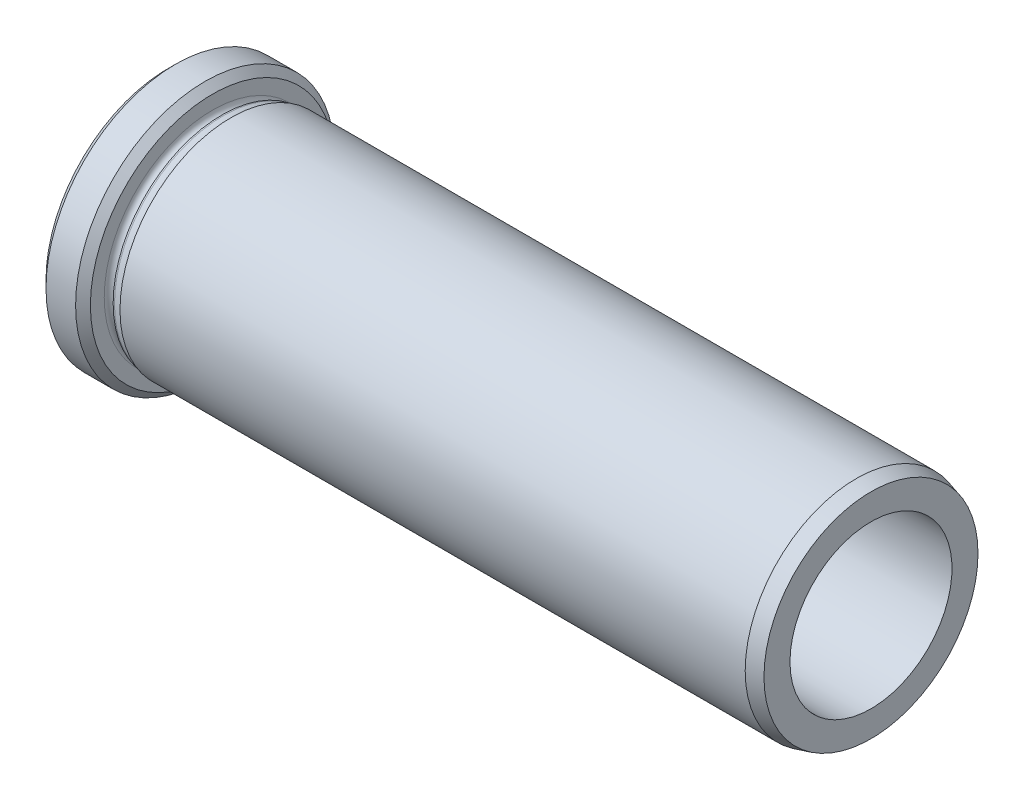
ISO-10303-21;
HEADER;
FILE_DESCRIPTION(('STEP AP214'),'2;1');
FILE_NAME('part.step','',(''),(''),'','','');
FILE_SCHEMA(('AUTOMOTIVE_DESIGN { 1 0 10303 214 1 1 1 1 }'));
ENDSEC;
DATA;
#1=APPLICATION_CONTEXT('core data for automotive mechanical design processes');
#2=APPLICATION_PROTOCOL_DEFINITION('international standard','automotive_design',2000,#1);
#3=PRODUCT_CONTEXT('',#1,'mechanical');
#4=PRODUCT('Part','Part','',(#3));
#5=PRODUCT_RELATED_PRODUCT_CATEGORY('part','',(#4));
#6=PRODUCT_DEFINITION_FORMATION('','',#4);
#7=PRODUCT_DEFINITION_CONTEXT('part definition',#1,'design');
#8=PRODUCT_DEFINITION('design','',#6,#7);
#9=PRODUCT_DEFINITION_SHAPE('','',#8);
#10=(LENGTH_UNIT() NAMED_UNIT(*) SI_UNIT(.MILLI.,.METRE.));
#11=(NAMED_UNIT(*) PLANE_ANGLE_UNIT() SI_UNIT($,.RADIAN.));
#12=(NAMED_UNIT(*) SI_UNIT($,.STERADIAN.) SOLID_ANGLE_UNIT());
#13=UNCERTAINTY_MEASURE_WITH_UNIT(LENGTH_MEASURE(1.E-05),#10,'distance_accuracy_value','');
#14=(GEOMETRIC_REPRESENTATION_CONTEXT(3) GLOBAL_UNCERTAINTY_ASSIGNED_CONTEXT((#13)) GLOBAL_UNIT_ASSIGNED_CONTEXT((#10,
#11,#12)) REPRESENTATION_CONTEXT('',''));
#15=CARTESIAN_POINT('',(0.,0.,0.));
#16=DIRECTION('',(0.,0.,1.));
#17=DIRECTION('',(1.,0.,0.));
#18=AXIS2_PLACEMENT_3D('',#15,#16,#17);
#19=CARTESIAN_POINT('',(30.9097582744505,10.95,0.));
#20=DIRECTION('',(1.,0.,0.));
#21=DIRECTION('',(0.,0.,-1.));
#22=AXIS2_PLACEMENT_3D('',#19,#20,#21);
#23=PLANE('',#22);
#24=CARTESIAN_POINT('',(30.9097582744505,0.,0.));
#25=DIRECTION('',(-1.,0.,0.));
#26=DIRECTION('',(0.,0.,1.));
#27=AXIS2_PLACEMENT_3D('',#24,#25,#26);
#28=CIRCLE('',#27,10.95);
#29=CARTESIAN_POINT('',(30.9097582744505,0.,10.95));
#30=VERTEX_POINT('',#29);
#31=EDGE_CURVE('E40',#30,#30,#28,.T.);
#32=ORIENTED_EDGE('',*,*,#31,.F.);
#33=EDGE_LOOP('',(#32));
#34=FACE_BOUND('',#33,.T.);
#35=CARTESIAN_POINT('',(30.9097582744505,0.,0.));
#36=DIRECTION('',(-1.,0.,0.));
#37=DIRECTION('',(0.,0.,1.));
#38=AXIS2_PLACEMENT_3D('',#35,#36,#37);
#39=CIRCLE('',#38,11.);
#40=CARTESIAN_POINT('',(30.9097582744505,0.,11.));
#41=VERTEX_POINT('',#40);
#42=EDGE_CURVE('E67',#41,#41,#39,.T.);
#43=ORIENTED_EDGE('',*,*,#42,.T.);
#44=EDGE_LOOP('',(#43));
#45=FACE_BOUND('',#44,.T.);
#46=ADVANCED_FACE('F14',(#34,#45),#23,.F.);
#47=CARTESIAN_POINT('',(0.,0.,0.));
#48=DIRECTION('',(-1.,0.,0.));
#49=DIRECTION('',(0.,0.,1.));
#50=AXIS2_PLACEMENT_3D('',#47,#48,#49);
#51=CYLINDRICAL_SURFACE('',#50,10.95);
#52=CARTESIAN_POINT('',(95.9097582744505,0.,0.));
#53=DIRECTION('',(-1.,0.,0.));
#54=DIRECTION('',(0.,0.,1.));
#55=AXIS2_PLACEMENT_3D('',#52,#53,#54);
#56=CIRCLE('',#55,10.95);
#57=CARTESIAN_POINT('',(95.9097582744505,0.,10.95));
#58=VERTEX_POINT('',#57);
#59=EDGE_CURVE('E43',#58,#58,#56,.T.);
#60=ORIENTED_EDGE('',*,*,#59,.F.);
#61=EDGE_LOOP('',(#60));
#62=FACE_BOUND('',#61,.T.);
#63=ORIENTED_EDGE('',*,*,#31,.T.);
#64=EDGE_LOOP('',(#63));
#65=FACE_BOUND('',#64,.T.);
#66=ADVANCED_FACE('F91',(#62,#65),#51,.F.);
#67=CARTESIAN_POINT('',(95.9097582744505,14.4641016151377,0.));
#68=DIRECTION('',(-1.,0.,0.));
#69=DIRECTION('',(0.,0.,1.));
#70=AXIS2_PLACEMENT_3D('',#67,#68,#69);
#71=PLANE('',#70);
#72=CARTESIAN_POINT('',(95.9097582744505,0.,0.));
#73=DIRECTION('',(-1.,0.,0.));
#74=DIRECTION('',(0.,0.,1.));
#75=AXIS2_PLACEMENT_3D('',#72,#73,#74);
#76=CIRCLE('',#75,14.4641016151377);
#77=CARTESIAN_POINT('',(95.9097582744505,0.,14.4641016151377));
#78=VERTEX_POINT('',#77);
#79=EDGE_CURVE('E46',#78,#78,#76,.T.);
#80=ORIENTED_EDGE('',*,*,#79,.F.);
#81=EDGE_LOOP('',(#80));
#82=FACE_BOUND('',#81,.T.);
#83=ORIENTED_EDGE('',*,*,#59,.T.);
#84=EDGE_LOOP('',(#83));
#85=FACE_BOUND('',#84,.T.);
#86=ADVANCED_FACE('F98',(#82,#85),#71,.F.);
#87=CARTESIAN_POINT('',(95.9097582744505,0.,0.));
#88=DIRECTION('',(-1.,0.,0.));
#89=DIRECTION('',(0.,0.,1.));
#90=AXIS2_PLACEMENT_3D('',#87,#88,#89);
#91=CONICAL_SURFACE('',#90,14.4641016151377,0.26179938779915);
#92=CARTESIAN_POINT('',(93.9097582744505,0.,0.));
#93=DIRECTION('',(-1.,0.,0.));
#94=DIRECTION('',(0.,0.,1.));
#95=AXIS2_PLACEMENT_3D('',#92,#93,#94);
#96=CIRCLE('',#95,15.);
#97=CARTESIAN_POINT('',(93.9097582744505,0.,15.));
#98=VERTEX_POINT('',#97);
#99=EDGE_CURVE('E49',#98,#98,#96,.T.);
#100=ORIENTED_EDGE('',*,*,#99,.F.);
#101=EDGE_LOOP('',(#100));
#102=FACE_BOUND('',#101,.T.);
#103=ORIENTED_EDGE('',*,*,#79,.T.);
#104=EDGE_LOOP('',(#103));
#105=FACE_BOUND('',#104,.T.);
#106=ADVANCED_FACE('F196',(#102,#105),#91,.T.);
#107=CARTESIAN_POINT('',(0.,0.,0.));
#108=DIRECTION('',(-1.,0.,0.));
#109=DIRECTION('',(0.,0.,1.));
#110=AXIS2_PLACEMENT_3D('',#107,#108,#109);
#111=CYLINDRICAL_SURFACE('',#110,15.);
#112=CARTESIAN_POINT('',(9.4097582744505,0.,0.));
#113=DIRECTION('',(-1.,0.,0.));
#114=DIRECTION('',(0.,0.,1.));
#115=AXIS2_PLACEMENT_3D('',#112,#113,#114);
#116=CIRCLE('',#115,15.);
#117=CARTESIAN_POINT('',(9.4097582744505,0.,15.));
#118=VERTEX_POINT('',#117);
#119=EDGE_CURVE('E52',#118,#118,#116,.T.);
#120=ORIENTED_EDGE('',*,*,#119,.F.);
#121=EDGE_LOOP('',(#120));
#122=FACE_BOUND('',#121,.T.);
#123=ORIENTED_EDGE('',*,*,#99,.T.);
#124=EDGE_LOOP('',(#123));
#125=FACE_BOUND('',#124,.T.);
#126=ADVANCED_FACE('F186',(#122,#125),#111,.T.);
#127=CARTESIAN_POINT('',(9.4097582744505,0.,0.));
#128=DIRECTION('',(1.,0.,0.));
#129=DIRECTION('',(0.,0.,-1.));
#130=AXIS2_PLACEMENT_3D('',#127,#128,#129);
#131=CONICAL_SURFACE('',#130,15.,0.261799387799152);
#132=CARTESIAN_POINT('',(8.39187627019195,0.,0.));
#133=DIRECTION('',(-1.,0.,0.));
#134=DIRECTION('',(0.,0.,1.));
#135=AXIS2_PLACEMENT_3D('',#132,#133,#134);
#136=CIRCLE('',#135,14.7272593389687);
#137=CARTESIAN_POINT('',(8.39187627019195,0.,14.7272593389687));
#138=VERTEX_POINT('',#137);
#139=EDGE_CURVE('E55',#138,#138,#136,.T.);
#140=ORIENTED_EDGE('',*,*,#139,.F.);
#141=EDGE_LOOP('',(#140));
#142=FACE_BOUND('',#141,.T.);
#143=ORIENTED_EDGE('',*,*,#119,.T.);
#144=EDGE_LOOP('',(#143));
#145=FACE_BOUND('',#144,.T.);
#146=ADVANCED_FACE('F176',(#142,#145),#131,.T.);
#147=CARTESIAN_POINT('',(8.18482103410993,0.,0.));
#148=DIRECTION('',(-1.,0.,0.));
#149=DIRECTION('',(0.,0.,1.));
#150=AXIS2_PLACEMENT_3D('',#147,#148,#149);
#151=TOROIDAL_SURFACE('',#150,15.5,0.8);
#152=CARTESIAN_POINT('',(8.18482103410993,0.,0.));
#153=DIRECTION('',(-1.,0.,0.));
#154=DIRECTION('',(0.,0.,1.));
#155=AXIS2_PLACEMENT_3D('',#152,#153,#154);
#156=CIRCLE('',#155,14.7);
#157=CARTESIAN_POINT('',(8.18482103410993,0.,14.7));
#158=VERTEX_POINT('',#157);
#159=EDGE_CURVE('E58',#158,#158,#156,.T.);
#160=ORIENTED_EDGE('',*,*,#159,.F.);
#161=EDGE_LOOP('',(#160));
#162=FACE_BOUND('',#161,.T.);
#163=ORIENTED_EDGE('',*,*,#139,.T.);
#164=EDGE_LOOP('',(#163));
#165=FACE_BOUND('',#164,.T.);
#166=ADVANCED_FACE('F166',(#162,#165),#151,.F.);
#167=CARTESIAN_POINT('',(0.,0.,0.));
#168=DIRECTION('',(-1.,0.,0.));
#169=DIRECTION('',(0.,0.,1.));
#170=AXIS2_PLACEMENT_3D('',#167,#168,#169);
#171=CYLINDRICAL_SURFACE('',#170,14.7);
#172=CARTESIAN_POINT('',(8.50662597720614,0.,0.));
#173=DIRECTION('',(-1.,0.,0.));
#174=DIRECTION('',(0.,0.,1.));
#175=AXIS2_PLACEMENT_3D('',#172,#173,#174);
#176=CIRCLE('',#175,14.7);
#177=CARTESIAN_POINT('',(8.50662597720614,0.,14.7));
#178=VERTEX_POINT('',#177);
#179=EDGE_CURVE('E61',#178,#178,#176,.T.);
#180=ORIENTED_EDGE('',*,*,#179,.F.);
#181=EDGE_LOOP('',(#180));
#182=FACE_BOUND('',#181,.T.);
#183=ORIENTED_EDGE('',*,*,#159,.T.);
#184=EDGE_LOOP('',(#183));
#185=FACE_BOUND('',#184,.T.);
#186=ADVANCED_FACE('F156',(#182,#185),#171,.F.);
#187=CARTESIAN_POINT('',(7.7097582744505,0.,0.));
#188=DIRECTION('',(-1.,0.,0.));
#189=DIRECTION('',(0.,0.,1.));
#190=AXIS2_PLACEMENT_3D('',#187,#188,#189);
#191=TOROIDAL_SURFACE('',#190,14.6292761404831,0.8);
#192=CARTESIAN_POINT('',(6.9097582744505,0.,0.));
#193=DIRECTION('',(-1.,0.,0.));
#194=DIRECTION('',(0.,0.,1.));
#195=AXIS2_PLACEMENT_3D('',#192,#193,#194);
#196=CIRCLE('',#195,14.6292761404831);
#197=CARTESIAN_POINT('',(6.9097582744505,0.,14.6292761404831));
#198=VERTEX_POINT('',#197);
#199=EDGE_CURVE('E64',#198,#198,#196,.T.);
#200=ORIENTED_EDGE('',*,*,#199,.F.);
#201=EDGE_LOOP('',(#200));
#202=FACE_BOUND('',#201,.T.);
#203=ORIENTED_EDGE('',*,*,#179,.T.);
#204=EDGE_LOOP('',(#203));
#205=FACE_BOUND('',#204,.T.);
#206=ADVANCED_FACE('F147',(#202,#205),#191,.F.);
#207=CARTESIAN_POINT('',(6.9097582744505,17.5,0.));
#208=DIRECTION('',(-1.,0.,0.));
#209=DIRECTION('',(0.,0.,1.));
#210=AXIS2_PLACEMENT_3D('',#207,#208,#209);
#211=PLANE('',#210);
#212=CARTESIAN_POINT('',(6.9097582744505,0.,0.));
#213=DIRECTION('',(-1.,0.,0.));
#214=DIRECTION('',(0.,0.,1.));
#215=AXIS2_PLACEMENT_3D('',#212,#213,#214);
#216=CIRCLE('',#215,16.5);
#217=CARTESIAN_POINT('',(6.9097582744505,0.,16.5));
#218=VERTEX_POINT('',#217);
#219=EDGE_CURVE('E9',#218,#218,#216,.F.);
#220=ORIENTED_EDGE('',*,*,#219,.T.);
#221=EDGE_LOOP('',(#220));
#222=FACE_BOUND('',#221,.T.);
#223=ORIENTED_EDGE('',*,*,#199,.T.);
#224=EDGE_LOOP('',(#223));
#225=FACE_BOUND('',#224,.T.);
#226=ADVANCED_FACE('F137',(#222,#225),#211,.F.);
#227=CARTESIAN_POINT('',(0.,0.,0.));
#228=DIRECTION('',(-1.,0.,0.));
#229=DIRECTION('',(0.,0.,1.));
#230=AXIS2_PLACEMENT_3D('',#227,#228,#229);
#231=CYLINDRICAL_SURFACE('',#230,17.5);
#232=CARTESIAN_POINT('',(5.90975827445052,0.,0.));
#233=DIRECTION('',(-1.,0.,0.));
#234=DIRECTION('',(0.,0.,1.));
#235=AXIS2_PLACEMENT_3D('',#232,#233,#234);
#236=CIRCLE('',#235,17.5);
#237=CARTESIAN_POINT('',(5.90975827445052,0.,17.5));
#238=VERTEX_POINT('',#237);
#239=EDGE_CURVE('E21',#238,#238,#236,.T.);
#240=ORIENTED_EDGE('',*,*,#239,.T.);
#241=EDGE_LOOP('',(#240));
#242=FACE_BOUND('',#241,.T.);
#243=CARTESIAN_POINT('',(1.90975827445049,0.,0.));
#244=DIRECTION('',(1.,0.,0.));
#245=DIRECTION('',(0.,0.,-1.));
#246=AXIS2_PLACEMENT_3D('',#243,#244,#245);
#247=CIRCLE('',#246,17.5);
#248=CARTESIAN_POINT('',(1.90975827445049,0.,-17.5));
#249=VERTEX_POINT('',#248);
#250=EDGE_CURVE('E34',#249,#249,#247,.T.);
#251=ORIENTED_EDGE('',*,*,#250,.T.);
#252=EDGE_LOOP('',(#251));
#253=FACE_BOUND('',#252,.T.);
#254=ADVANCED_FACE('F87',(#242,#253),#231,.T.);
#255=CARTESIAN_POINT('',(0.909758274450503,17.5,0.));
#256=DIRECTION('',(1.,0.,0.));
#257=DIRECTION('',(0.,0.,-1.));
#258=AXIS2_PLACEMENT_3D('',#255,#256,#257);
#259=PLANE('',#258);
#260=CARTESIAN_POINT('',(0.909758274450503,0.,0.));
#261=DIRECTION('',(1.,0.,0.));
#262=DIRECTION('',(0.,0.,-1.));
#263=AXIS2_PLACEMENT_3D('',#260,#261,#262);
#264=CIRCLE('',#263,12.5);
#265=CARTESIAN_POINT('',(0.909758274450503,0.,-12.5));
#266=VERTEX_POINT('',#265);
#267=EDGE_CURVE('E25',#266,#266,#264,.T.);
#268=ORIENTED_EDGE('',*,*,#267,.T.);
#269=EDGE_LOOP('',(#268));
#270=FACE_BOUND('',#269,.T.);
#271=CARTESIAN_POINT('',(0.909758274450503,0.,0.));
#272=DIRECTION('',(1.,0.,0.));
#273=DIRECTION('',(0.,0.,-1.));
#274=AXIS2_PLACEMENT_3D('',#271,#272,#273);
#275=CIRCLE('',#274,16.5);
#276=CARTESIAN_POINT('',(0.909758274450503,0.,-16.5));
#277=VERTEX_POINT('',#276);
#278=EDGE_CURVE('E37',#277,#277,#275,.F.);
#279=ORIENTED_EDGE('',*,*,#278,.T.);
#280=EDGE_LOOP('',(#279));
#281=FACE_BOUND('',#280,.T.);
#282=ADVANCED_FACE('F75',(#270,#281),#259,.F.);
#283=CARTESIAN_POINT('',(0.,0.,0.));
#284=DIRECTION('',(-1.,0.,0.));
#285=DIRECTION('',(0.,0.,1.));
#286=AXIS2_PLACEMENT_3D('',#283,#284,#285);
#287=CYLINDRICAL_SURFACE('',#286,11.);
#288=CARTESIAN_POINT('',(2.40975827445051,0.,0.));
#289=DIRECTION('',(1.,0.,0.));
#290=DIRECTION('',(0.,0.,-1.));
#291=AXIS2_PLACEMENT_3D('',#288,#289,#290);
#292=CIRCLE('',#291,11.);
#293=CARTESIAN_POINT('',(2.40975827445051,0.,-11.));
#294=VERTEX_POINT('',#293);
#295=EDGE_CURVE('E29',#294,#294,#292,.F.);
#296=ORIENTED_EDGE('',*,*,#295,.T.);
#297=EDGE_LOOP('',(#296));
#298=FACE_BOUND('',#297,.T.);
#299=ORIENTED_EDGE('',*,*,#42,.F.);
#300=EDGE_LOOP('',(#299));
#301=FACE_BOUND('',#300,.T.);
#302=ADVANCED_FACE('F72',(#298,#301),#287,.F.);
#303=CARTESIAN_POINT('',(0.909758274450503,0.,0.));
#304=DIRECTION('',(1.,0.,0.));
#305=DIRECTION('',(0.,0.,-1.));
#306=AXIS2_PLACEMENT_3D('',#303,#304,#305);
#307=CONICAL_SURFACE('',#306,16.5,0.785398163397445);
#308=ORIENTED_EDGE('',*,*,#250,.F.);
#309=EDGE_LOOP('',(#308));
#310=FACE_BOUND('',#309,.T.);
#311=ORIENTED_EDGE('',*,*,#278,.F.);
#312=EDGE_LOOP('',(#311));
#313=FACE_BOUND('',#312,.T.);
#314=ADVANCED_FACE('F74',(#310,#313),#307,.T.);
#315=CARTESIAN_POINT('',(2.40975827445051,0.,0.));
#316=DIRECTION('',(1.,0.,0.));
#317=DIRECTION('',(0.,0.,-1.));
#318=AXIS2_PLACEMENT_3D('',#315,#316,#317);
#319=TOROIDAL_SURFACE('',#318,12.5,1.5);
#320=ORIENTED_EDGE('',*,*,#267,.F.);
#321=EDGE_LOOP('',(#320));
#322=FACE_BOUND('',#321,.T.);
#323=ORIENTED_EDGE('',*,*,#295,.F.);
#324=EDGE_LOOP('',(#323));
#325=FACE_BOUND('',#324,.T.);
#326=ADVANCED_FACE('F84',(#322,#325),#319,.T.);
#327=CARTESIAN_POINT('',(5.90975827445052,0.,0.));
#328=DIRECTION('',(-1.,0.,0.));
#329=DIRECTION('',(0.,0.,1.));
#330=AXIS2_PLACEMENT_3D('',#327,#328,#329);
#331=CONICAL_SURFACE('',#330,17.5,0.785398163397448);
#332=ORIENTED_EDGE('',*,*,#219,.F.);
#333=EDGE_LOOP('',(#332));
#334=FACE_BOUND('',#333,.T.);
#335=ORIENTED_EDGE('',*,*,#239,.F.);
#336=EDGE_LOOP('',(#335));
#337=FACE_BOUND('',#336,.T.);
#338=ADVANCED_FACE('F16',(#334,#337),#331,.T.);
#339=CLOSED_SHELL('',(#46,#66,#86,#106,#126,#146,#166,#186,#206,#226,#254,#282,#302,#314,#326,#338));
#340=MANIFOLD_SOLID_BREP('B1',#339);
#341=ADVANCED_BREP_SHAPE_REPRESENTATION('',(#18,#340),#14);
#342=SHAPE_DEFINITION_REPRESENTATION(#9,#341);
ENDSEC;
END-ISO-10303-21;
